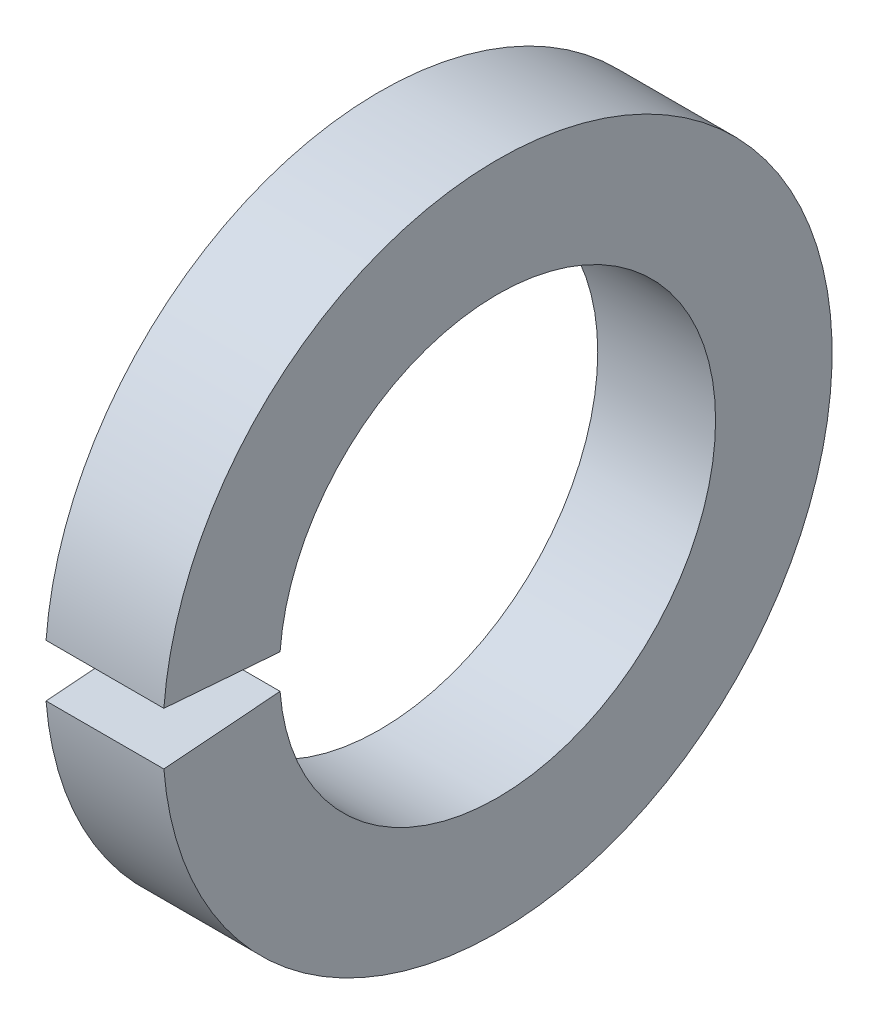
ISO-10303-21;
HEADER;
FILE_DESCRIPTION(('STEP AP214'),'2;1');
FILE_NAME('part.step','',(''),(''),'','','');
FILE_SCHEMA(('AUTOMOTIVE_DESIGN { 1 0 10303 214 1 1 1 1 }'));
ENDSEC;
DATA;
#1=APPLICATION_CONTEXT('core data for automotive mechanical design processes');
#2=APPLICATION_PROTOCOL_DEFINITION('international standard','automotive_design',2000,#1);
#3=PRODUCT_CONTEXT('',#1,'mechanical');
#4=PRODUCT('Part','Part','',(#3));
#5=PRODUCT_RELATED_PRODUCT_CATEGORY('part','',(#4));
#6=PRODUCT_DEFINITION_FORMATION('','',#4);
#7=PRODUCT_DEFINITION_CONTEXT('part definition',#1,'design');
#8=PRODUCT_DEFINITION('design','',#6,#7);
#9=PRODUCT_DEFINITION_SHAPE('','',#8);
#10=(LENGTH_UNIT() NAMED_UNIT(*) SI_UNIT(.MILLI.,.METRE.));
#11=(NAMED_UNIT(*) PLANE_ANGLE_UNIT() SI_UNIT($,.RADIAN.));
#12=(NAMED_UNIT(*) SI_UNIT($,.STERADIAN.) SOLID_ANGLE_UNIT());
#13=UNCERTAINTY_MEASURE_WITH_UNIT(LENGTH_MEASURE(1.E-05),#10,'distance_accuracy_value','');
#14=(GEOMETRIC_REPRESENTATION_CONTEXT(3) GLOBAL_UNCERTAINTY_ASSIGNED_CONTEXT((#13)) GLOBAL_UNIT_ASSIGNED_CONTEXT((#10,
#11,#12)) REPRESENTATION_CONTEXT('',''));
#15=CARTESIAN_POINT('',(0.,0.,0.));
#16=DIRECTION('',(0.,0.,1.));
#17=DIRECTION('',(1.,0.,0.));
#18=AXIS2_PLACEMENT_3D('',#15,#16,#17);
#19=CARTESIAN_POINT('',(-34.9249999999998,0.,0.));
#20=DIRECTION('',(-1.,0.,0.));
#21=DIRECTION('',(0.,0.,1.));
#22=AXIS2_PLACEMENT_3D('',#19,#20,#21);
#23=CYLINDRICAL_SURFACE('',#22,2.2098);
#24=CARTESIAN_POINT('',(0.,0.,0.));
#25=DIRECTION('',(-1.,0.,0.));
#26=DIRECTION('',(0.,0.,1.));
#27=AXIS2_PLACEMENT_3D('',#24,#25,#26);
#28=CIRCLE('',#27,2.2098);
#29=CARTESIAN_POINT('',(0.,0.173378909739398,2.20298792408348));
#30=VERTEX_POINT('',#29);
#31=CARTESIAN_POINT('',(0.,-0.173378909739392,2.20298792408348));
#32=VERTEX_POINT('',#31);
#33=EDGE_CURVE('E85',#30,#32,#28,.T.);
#34=ORIENTED_EDGE('',*,*,#33,.F.);
#35=DIRECTION('',(-1.,0.,0.));
#36=VECTOR('',#35,1.);
#37=CARTESIAN_POINT('',(-34.9249999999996,0.173378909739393,2.20298792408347));
#38=LINE('',#37,#36);
#39=CARTESIAN_POINT('',(-1.19380000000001,0.173378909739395,2.20298792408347));
#40=VERTEX_POINT('',#39);
#41=EDGE_CURVE('E99',#30,#40,#38,.T.);
#42=ORIENTED_EDGE('',*,*,#41,.T.);
#43=CARTESIAN_POINT('',(-1.19379999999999,0.,0.));
#44=DIRECTION('',(-1.,0.,0.));
#45=DIRECTION('',(0.,0.,1.));
#46=AXIS2_PLACEMENT_3D('',#43,#44,#45);
#47=CIRCLE('',#46,2.2098);
#48=CARTESIAN_POINT('',(-1.19380000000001,-0.173378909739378,2.20298792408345));
#49=VERTEX_POINT('',#48);
#50=EDGE_CURVE('E87',#40,#49,#47,.T.);
#51=ORIENTED_EDGE('',*,*,#50,.T.);
#52=DIRECTION('',(-1.,0.,0.));
#53=VECTOR('',#52,1.);
#54=CARTESIAN_POINT('',(-34.9249999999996,-0.173378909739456,2.20298792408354));
#55=LINE('',#54,#53);
#56=EDGE_CURVE('E55',#32,#49,#55,.T.);
#57=ORIENTED_EDGE('',*,*,#56,.F.);
#58=EDGE_LOOP('',(#34,#42,#51,#57));
#59=FACE_BOUND('',#58,.T.);
#60=ADVANCED_FACE('F34',(#59),#23,.F.);
#61=CARTESIAN_POINT('',(0.,2.20979999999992,0.));
#62=DIRECTION('',(-1.,0.,0.));
#63=DIRECTION('',(0.,0.,1.));
#64=AXIS2_PLACEMENT_3D('',#61,#62,#63);
#65=PLANE('',#64);
#66=CARTESIAN_POINT('',(0.,0.,0.));
#67=DIRECTION('',(-1.,0.,0.));
#68=DIRECTION('',(0.,0.,1.));
#69=AXIS2_PLACEMENT_3D('',#66,#67,#68);
#70=CIRCLE('',#69,3.3909);
#71=CARTESIAN_POINT('',(0.,0.266046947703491,3.38044698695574));
#72=VERTEX_POINT('',#71);
#73=CARTESIAN_POINT('',(0.,-0.266046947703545,3.3804469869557));
#74=VERTEX_POINT('',#73);
#75=EDGE_CURVE('E91',#72,#74,#70,.T.);
#76=ORIENTED_EDGE('',*,*,#75,.F.);
#77=DIRECTION('',(0.,0.0784590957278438,0.996917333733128));
#78=VECTOR('',#77,1.);
#79=CARTESIAN_POINT('',(0.,0.,0.));
#80=LINE('',#79,#78);
#81=EDGE_CURVE('E79',#30,#72,#80,.T.);
#82=ORIENTED_EDGE('',*,*,#81,.F.);
#83=ORIENTED_EDGE('',*,*,#33,.T.);
#84=DIRECTION('',(0.,-0.0784590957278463,0.996917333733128));
#85=VECTOR('',#84,1.);
#86=CARTESIAN_POINT('',(0.,0.,0.));
#87=LINE('',#86,#85);
#88=EDGE_CURVE('E71',#32,#74,#87,.T.);
#89=ORIENTED_EDGE('',*,*,#88,.T.);
#90=EDGE_LOOP('',(#76,#82,#83,#89));
#91=FACE_BOUND('',#90,.T.);
#92=ADVANCED_FACE('F90',(#91),#65,.F.);
#93=CARTESIAN_POINT('',(-34.9249999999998,0.,0.));
#94=DIRECTION('',(-1.,0.,0.));
#95=DIRECTION('',(0.,0.,1.));
#96=AXIS2_PLACEMENT_3D('',#93,#94,#95);
#97=CYLINDRICAL_SURFACE('',#96,3.3909);
#98=CARTESIAN_POINT('',(-1.19379999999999,0.,0.));
#99=DIRECTION('',(-1.,0.,0.));
#100=DIRECTION('',(0.,0.,1.));
#101=AXIS2_PLACEMENT_3D('',#98,#99,#100);
#102=CIRCLE('',#101,3.3909);
#103=CARTESIAN_POINT('',(-1.19380000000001,0.266046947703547,3.38044698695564));
#104=VERTEX_POINT('',#103);
#105=CARTESIAN_POINT('',(-1.19380000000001,-0.266046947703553,3.38044698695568));
#106=VERTEX_POINT('',#105);
#107=EDGE_CURVE('E93',#104,#106,#102,.T.);
#108=ORIENTED_EDGE('',*,*,#107,.F.);
#109=DIRECTION('',(-1.,0.,0.));
#110=VECTOR('',#109,1.);
#111=CARTESIAN_POINT('',(-34.9249999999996,0.26604694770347,3.38044698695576));
#112=LINE('',#111,#110);
#113=EDGE_CURVE('E48',#104,#72,#112,.F.);
#114=ORIENTED_EDGE('',*,*,#113,.T.);
#115=ORIENTED_EDGE('',*,*,#75,.T.);
#116=DIRECTION('',(-1.,0.,0.));
#117=VECTOR('',#116,1.);
#118=CARTESIAN_POINT('',(-34.9249999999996,-0.26604694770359,3.38044698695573));
#119=LINE('',#118,#117);
#120=EDGE_CURVE('E74',#106,#74,#119,.F.);
#121=ORIENTED_EDGE('',*,*,#120,.F.);
#122=EDGE_LOOP('',(#108,#114,#115,#121));
#123=FACE_BOUND('',#122,.T.);
#124=ADVANCED_FACE('F106',(#123),#97,.T.);
#125=CARTESIAN_POINT('',(-1.19379999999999,3.3909,0.));
#126=DIRECTION('',(1.,0.,0.));
#127=DIRECTION('',(0.,0.,-1.));
#128=AXIS2_PLACEMENT_3D('',#125,#126,#127);
#129=PLANE('',#128);
#130=ORIENTED_EDGE('',*,*,#50,.F.);
#131=DIRECTION('',(0.,0.0784590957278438,0.996917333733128));
#132=VECTOR('',#131,1.);
#133=CARTESIAN_POINT('',(-1.19380000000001,0.0208738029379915,0.265226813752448));
#134=LINE('',#133,#132);
#135=EDGE_CURVE('E11',#40,#104,#134,.T.);
#136=ORIENTED_EDGE('',*,*,#135,.T.);
#137=ORIENTED_EDGE('',*,*,#107,.T.);
#138=DIRECTION('',(0.,-0.0784590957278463,0.996917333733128));
#139=VECTOR('',#138,1.);
#140=CARTESIAN_POINT('',(-1.19379999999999,0.0208738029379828,-0.265226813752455));
#141=LINE('',#140,#139);
#142=EDGE_CURVE('E41',#49,#106,#141,.T.);
#143=ORIENTED_EDGE('',*,*,#142,.F.);
#144=EDGE_LOOP('',(#130,#136,#137,#143));
#145=FACE_BOUND('',#144,.T.);
#146=ADVANCED_FACE('F108',(#145),#129,.F.);
#147=CARTESIAN_POINT('',(-1.19379999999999,0.,0.));
#148=DIRECTION('',(0.,0.996917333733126,0.0784590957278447));
#149=DIRECTION('',(0.,-0.0784590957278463,0.996917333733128));
#150=AXIS2_PLACEMENT_3D('',#147,#148,#149);
#151=PLANE('',#150);
#152=ORIENTED_EDGE('',*,*,#56,.T.);
#153=ORIENTED_EDGE('',*,*,#142,.T.);
#154=ORIENTED_EDGE('',*,*,#120,.T.);
#155=ORIENTED_EDGE('',*,*,#88,.F.);
#156=EDGE_LOOP('',(#152,#153,#154,#155));
#157=FACE_BOUND('',#156,.T.);
#158=ADVANCED_FACE('F72',(#157),#151,.T.);
#159=CARTESIAN_POINT('',(-1.19379999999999,0.,0.));
#160=DIRECTION('',(0.,0.996917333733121,-0.0784590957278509));
#161=DIRECTION('',(0.,0.0784590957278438,0.996917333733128));
#162=AXIS2_PLACEMENT_3D('',#159,#160,#161);
#163=PLANE('',#162);
#164=ORIENTED_EDGE('',*,*,#81,.T.);
#165=ORIENTED_EDGE('',*,*,#113,.F.);
#166=ORIENTED_EDGE('',*,*,#135,.F.);
#167=ORIENTED_EDGE('',*,*,#41,.F.);
#168=EDGE_LOOP('',(#164,#165,#166,#167));
#169=FACE_BOUND('',#168,.T.);
#170=ADVANCED_FACE('F103',(#169),#163,.F.);
#171=CLOSED_SHELL('',(#60,#92,#124,#146,#158,#170));
#172=MANIFOLD_SOLID_BREP('B2',#171);
#173=ADVANCED_BREP_SHAPE_REPRESENTATION('',(#18,#172),#14);
#174=SHAPE_DEFINITION_REPRESENTATION(#9,#173);
ENDSEC;
END-ISO-10303-21;
